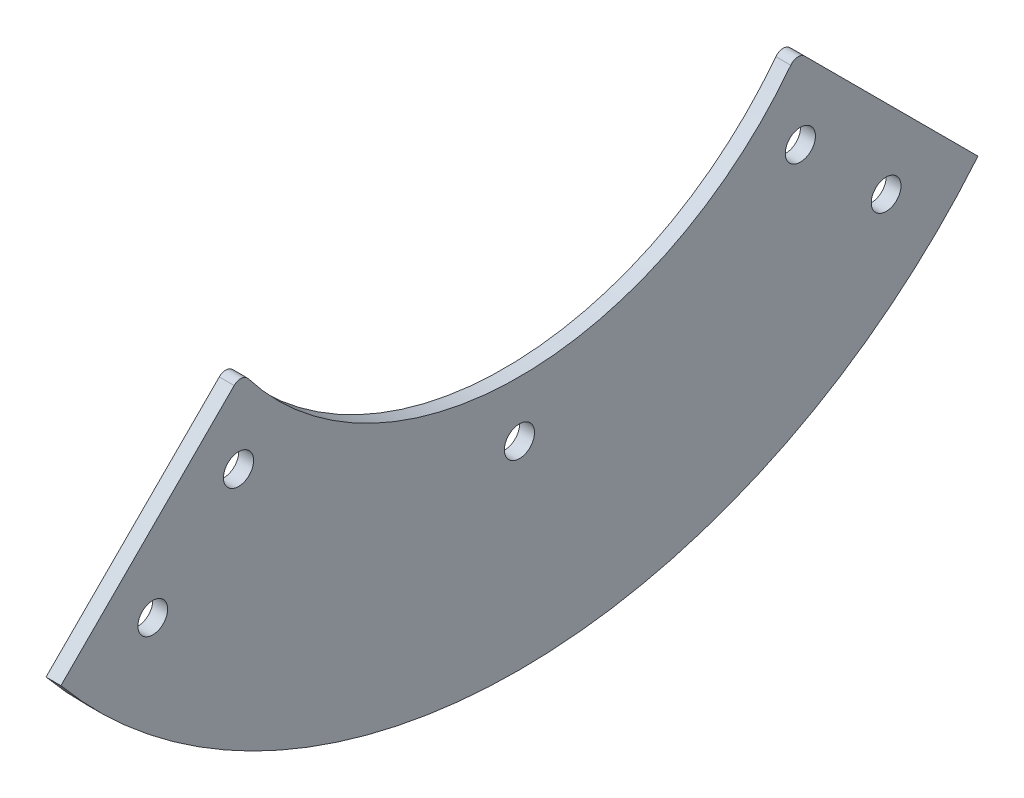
from build123d import *

# Parameters (mm, degrees)
SCHIZZO1_R                   = 4.05
SCHIZZO1_R_2                 = 4
SCHIZZO1_R_3                 = 4.000000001
ESTRUSIONE_ESTRUSIONE2_DEPTH = 4


with BuildPart() as part:
    # Schizzo1 → Estrusione-Estrusione2 (new body)
    with BuildSketch(Plane(origin=(0, 0, 0), x_dir=(0, 0, -1), z_dir=(1, 0, 0))):
        with BuildLine():
            Line((-86.102919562, -64.889716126), (-123.245404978, -102.032201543))
            ThreePointArc((-123.245404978, -102.032201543), (0, -160), (123.245404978, -102.032201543))
            Line((123.245404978, -102.032201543), (86.102919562, -64.889716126))
            Line((86.102919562, -64.889716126), (76.675467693, -55.462264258))
            ThreePointArc((76.675467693, -55.462264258), (74.741582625, -54.735556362), (72.921136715, -55.712281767))
            ThreePointArc((72.921136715, -55.712281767), (0, -91.767916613), (-72.921136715, -55.712281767))
            ThreePointArc((-72.921136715, -55.712281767), (-74.741582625, -54.735556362), (-76.675467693, -55.462264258))
            Line((-76.675467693, -55.462264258), (-86.102919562, -64.889716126))
        make_face()
        with Locations((75.496317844, -75.496317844)):
            Circle(SCHIZZO1_R, mode=Mode.SUBTRACT)
        with Locations((-75.496317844, -75.496317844)):
            Circle(SCHIZZO1_R, mode=Mode.SUBTRACT)
        with Locations((-98.55172785, -98.55172785)):
            Circle(SCHIZZO1_R_2, mode=Mode.SUBTRACT)
        with Locations((98.551727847, -98.55172785)):
            Circle(SCHIZZO1_R_3, mode=Mode.SUBTRACT)
        with Locations((0, -106.767916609)):
            Circle(SCHIZZO1_R, mode=Mode.SUBTRACT)
    extrude(amount=ESTRUSIONE_ESTRUSIONE2_DEPTH)


solid = part.part
